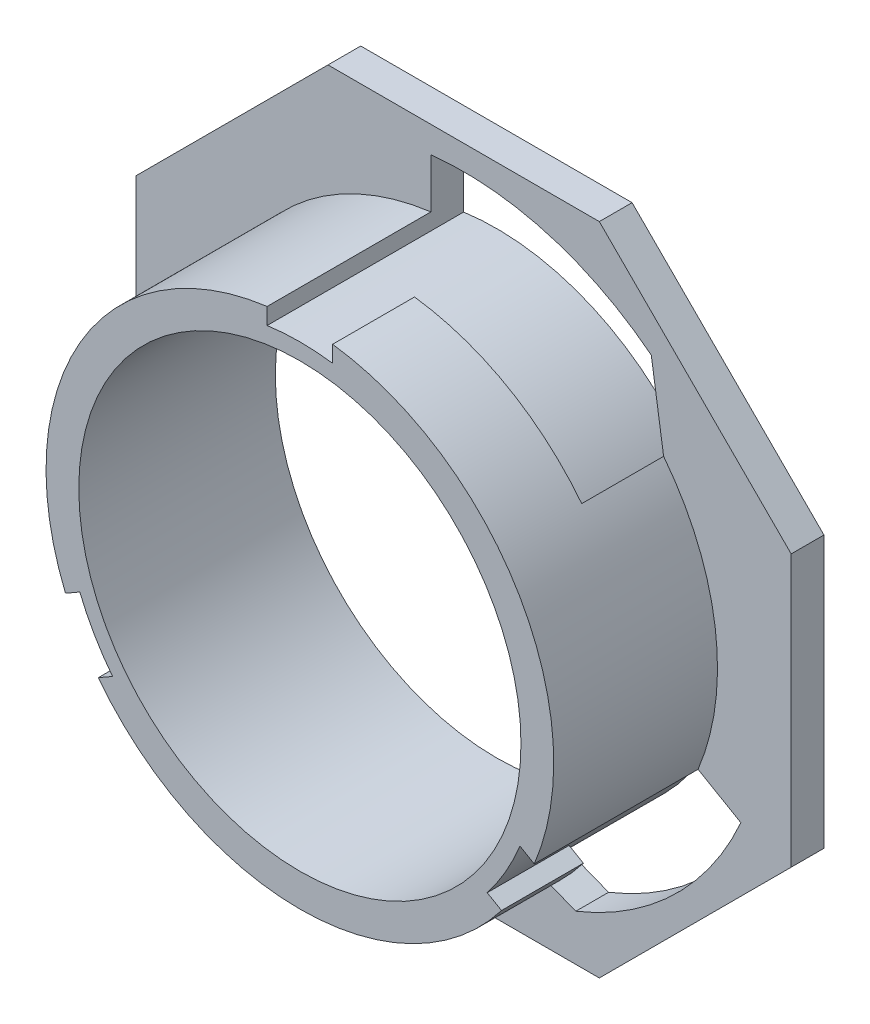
ISO-10303-21;
HEADER;
FILE_DESCRIPTION(('STEP AP214'),'2;1');
FILE_NAME('part.step','',(''),(''),'','','');
FILE_SCHEMA(('AUTOMOTIVE_DESIGN { 1 0 10303 214 1 1 1 1 }'));
ENDSEC;
DATA;
#1=APPLICATION_CONTEXT('core data for automotive mechanical design processes');
#2=APPLICATION_PROTOCOL_DEFINITION('international standard','automotive_design',2000,#1);
#3=PRODUCT_CONTEXT('',#1,'mechanical');
#4=PRODUCT('Part','Part','',(#3));
#5=PRODUCT_RELATED_PRODUCT_CATEGORY('part','',(#4));
#6=PRODUCT_DEFINITION_FORMATION('','',#4);
#7=PRODUCT_DEFINITION_CONTEXT('part definition',#1,'design');
#8=PRODUCT_DEFINITION('design','',#6,#7);
#9=PRODUCT_DEFINITION_SHAPE('','',#8);
#10=(LENGTH_UNIT() NAMED_UNIT(*) SI_UNIT(.MILLI.,.METRE.));
#11=(NAMED_UNIT(*) PLANE_ANGLE_UNIT() SI_UNIT($,.RADIAN.));
#12=(NAMED_UNIT(*) SI_UNIT($,.STERADIAN.) SOLID_ANGLE_UNIT());
#13=UNCERTAINTY_MEASURE_WITH_UNIT(LENGTH_MEASURE(1.E-05),#10,'distance_accuracy_value','');
#14=(GEOMETRIC_REPRESENTATION_CONTEXT(3) GLOBAL_UNCERTAINTY_ASSIGNED_CONTEXT((#13)) GLOBAL_UNIT_ASSIGNED_CONTEXT((#10,
#11,#12)) REPRESENTATION_CONTEXT('',''));
#15=CARTESIAN_POINT('',(0.,0.,0.));
#16=DIRECTION('',(0.,0.,1.));
#17=DIRECTION('',(1.,0.,0.));
#18=AXIS2_PLACEMENT_3D('',#15,#16,#17);
#19=CARTESIAN_POINT('',(0.,0.,12.));
#20=DIRECTION('',(0.,0.,-1.));
#21=DIRECTION('',(-1.,0.,0.));
#22=AXIS2_PLACEMENT_3D('',#19,#20,#21);
#23=CYLINDRICAL_SURFACE('',#22,15.5);
#24=CARTESIAN_POINT('',(0.,0.,12.));
#25=DIRECTION('',(0.,0.,1.));
#26=DIRECTION('',(1.,0.,0.));
#27=AXIS2_PLACEMENT_3D('',#24,#25,#26);
#28=CIRCLE('',#27,15.5);
#29=CARTESIAN_POINT('',(-12.3111795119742,-9.41726388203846,12.));
#30=VERTEX_POINT('',#29);
#31=CARTESIAN_POINT('',(12.3111795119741,-9.41726388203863,12.));
#32=VERTEX_POINT('',#31);
#33=EDGE_CURVE('E341',#30,#32,#28,.T.);
#34=ORIENTED_EDGE('',*,*,#33,.F.);
#35=DIRECTION('',(0.,0.,-1.));
#36=VECTOR('',#35,1.);
#37=CARTESIAN_POINT('',(-12.3111795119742,-9.41726388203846,12.));
#38=LINE('',#37,#36);
#39=CARTESIAN_POINT('',(-12.3111795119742,-9.41726388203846,2.));
#40=VERTEX_POINT('',#39);
#41=EDGE_CURVE('E11',#30,#40,#38,.T.);
#42=ORIENTED_EDGE('',*,*,#41,.T.);
#43=CARTESIAN_POINT('',(0.,0.,2.));
#44=DIRECTION('',(0.,0.,1.));
#45=DIRECTION('',(1.,0.,0.));
#46=AXIS2_PLACEMENT_3D('',#43,#44,#45);
#47=CIRCLE('',#46,15.5);
#48=CARTESIAN_POINT('',(2.16397596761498,-15.34819885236,2.));
#49=VERTEX_POINT('',#48);
#50=EDGE_CURVE('E345',#40,#49,#47,.T.);
#51=ORIENTED_EDGE('',*,*,#50,.T.);
#52=DIRECTION('',(0.,0.,-1.));
#53=VECTOR('',#52,1.);
#54=CARTESIAN_POINT('',(2.16397596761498,-15.34819885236,12.));
#55=LINE('',#54,#53);
#56=CARTESIAN_POINT('',(2.16397596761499,-15.34819885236,7.));
#57=VERTEX_POINT('',#56);
#58=EDGE_CURVE('E263',#49,#57,#55,.F.);
#59=ORIENTED_EDGE('',*,*,#58,.T.);
#60=CARTESIAN_POINT('',(0.,0.,7.));
#61=DIRECTION('',(0.,0.,-1.));
#62=DIRECTION('',(-1.,0.,0.));
#63=AXIS2_PLACEMENT_3D('',#60,#61,#62);
#64=CIRCLE('',#63,15.5);
#65=CARTESIAN_POINT('',(12.3111795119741,-9.41726388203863,7.));
#66=VERTEX_POINT('',#65);
#67=EDGE_CURVE('E268',#66,#57,#64,.T.);
#68=ORIENTED_EDGE('',*,*,#67,.F.);
#69=DIRECTION('',(0.,0.,-1.));
#70=VECTOR('',#69,1.);
#71=CARTESIAN_POINT('',(12.3111795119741,-9.41726388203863,12.));
#72=LINE('',#71,#70);
#73=EDGE_CURVE('E458',#32,#66,#72,.T.);
#74=ORIENTED_EDGE('',*,*,#73,.F.);
#75=EDGE_LOOP('',(#34,#42,#51,#59,#68,#74));
#76=FACE_BOUND('',#75,.T.);
#77=ADVANCED_FACE('F31',(#76),#23,.T.);
#78=CARTESIAN_POINT('',(14.3111795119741,-5.95316226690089,12.));
#79=VERTEX_POINT('',#78);
#80=CARTESIAN_POINT('',(2.,15.3704261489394,12.));
#81=VERTEX_POINT('',#80);
#82=EDGE_CURVE('E342',#79,#81,#28,.T.);
#83=ORIENTED_EDGE('',*,*,#82,.F.);
#84=DIRECTION('',(0.,0.,-1.));
#85=VECTOR('',#84,1.);
#86=CARTESIAN_POINT('',(14.3111795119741,-5.95316226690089,12.));
#87=LINE('',#86,#85);
#88=CARTESIAN_POINT('',(14.3111795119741,-5.95316226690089,2.));
#89=VERTEX_POINT('',#88);
#90=EDGE_CURVE('E260',#79,#89,#87,.T.);
#91=ORIENTED_EDGE('',*,*,#90,.T.);
#92=CARTESIAN_POINT('',(12.2099421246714,9.54815758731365,2.));
#93=VERTEX_POINT('',#92);
#94=EDGE_CURVE('E346',#89,#93,#47,.T.);
#95=ORIENTED_EDGE('',*,*,#94,.T.);
#96=DIRECTION('',(0.,0.,-1.));
#97=VECTOR('',#96,1.);
#98=CARTESIAN_POINT('',(12.2099421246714,9.54815758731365,12.));
#99=LINE('',#98,#97);
#100=CARTESIAN_POINT('',(12.2099421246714,9.54815758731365,7.));
#101=VERTEX_POINT('',#100);
#102=EDGE_CURVE('E273',#93,#101,#99,.F.);
#103=ORIENTED_EDGE('',*,*,#102,.T.);
#104=CARTESIAN_POINT('',(0.,0.,7.));
#105=DIRECTION('',(0.,0.,-1.));
#106=DIRECTION('',(-1.,0.,0.));
#107=AXIS2_PLACEMENT_3D('',#104,#105,#106);
#108=CIRCLE('',#107,15.5);
#109=CARTESIAN_POINT('',(2.,15.3704261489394,7.));
#110=VERTEX_POINT('',#109);
#111=EDGE_CURVE('E276',#110,#101,#108,.T.);
#112=ORIENTED_EDGE('',*,*,#111,.F.);
#113=DIRECTION('',(0.,0.,-1.));
#114=VECTOR('',#113,1.);
#115=CARTESIAN_POINT('',(2.,15.3704261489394,12.));
#116=LINE('',#115,#114);
#117=EDGE_CURVE('E382',#81,#110,#116,.T.);
#118=ORIENTED_EDGE('',*,*,#117,.F.);
#119=EDGE_LOOP('',(#83,#91,#95,#103,#112,#118));
#120=FACE_BOUND('',#119,.T.);
#121=ADVANCED_FACE('F527',(#120),#23,.T.);
#122=CARTESIAN_POINT('',(20.,20.,2.));
#123=DIRECTION('',(0.,0.,1.));
#124=DIRECTION('',(1.,0.,0.));
#125=AXIS2_PLACEMENT_3D('',#122,#123,#124);
#126=PLANE('',#125);
#127=DIRECTION('',(0.866025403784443,0.499999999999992,0.));
#128=VECTOR('',#127,1.);
#129=CARTESIAN_POINT('',(24.6602540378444,11.9282032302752,2.));
#130=LINE('',#129,#128);
#131=CARTESIAN_POINT('',(-14.9275704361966,-10.9278378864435,2.));
#132=VERTEX_POINT('',#131);
#133=EDGE_CURVE('E430',#132,#40,#130,.T.);
#134=ORIENTED_EDGE('',*,*,#133,.F.);
#135=CARTESIAN_POINT('',(0.,0.,2.));
#136=DIRECTION('',(0.,0.,1.));
#137=DIRECTION('',(1.,0.,0.));
#138=AXIS2_PLACEMENT_3D('',#135,#136,#137);
#139=CIRCLE('',#138,18.5);
#140=CARTESIAN_POINT('',(-18.3077579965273,2.66007464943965,2.));
#141=VERTEX_POINT('',#140);
#142=EDGE_CURVE('E428',#141,#132,#139,.T.);
#143=ORIENTED_EDGE('',*,*,#142,.F.);
#144=DIRECTION('',(-0.78155694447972,-0.623833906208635,0.));
#145=VECTOR('',#144,1.);
#146=CARTESIAN_POINT('',(13.5461018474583,28.0856280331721,2.));
#147=LINE('',#146,#145);
#148=CARTESIAN_POINT('',(-14.3739180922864,5.80004126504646,2.));
#149=VERTEX_POINT('',#148);
#150=EDGE_CURVE('E432',#149,#141,#147,.T.);
#151=ORIENTED_EDGE('',*,*,#150,.F.);
#152=CARTESIAN_POINT('',(-2.,15.3704261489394,2.));
#153=VERTEX_POINT('',#152);
#154=EDGE_CURVE('E343',#153,#149,#47,.T.);
#155=ORIENTED_EDGE('',*,*,#154,.F.);
#156=DIRECTION('',(0.,-1.,0.));
#157=VECTOR('',#156,1.);
#158=CARTESIAN_POINT('',(-2.,20.,2.));
#159=LINE('',#158,#157);
#160=CARTESIAN_POINT('',(-2.,18.3915741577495,2.));
#161=VERTEX_POINT('',#160);
#162=EDGE_CURVE('E352',#161,#153,#159,.T.);
#163=ORIENTED_EDGE('',*,*,#162,.F.);
#164=CARTESIAN_POINT('',(0.,0.,2.));
#165=DIRECTION('',(0.,0.,1.));
#166=DIRECTION('',(1.,0.,0.));
#167=AXIS2_PLACEMENT_3D('',#164,#165,#166);
#168=CIRCLE('',#167,18.5);
#169=CARTESIAN_POINT('',(11.4575712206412,14.5249461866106,2.));
#170=VERTEX_POINT('',#169);
#171=EDGE_CURVE('E350',#170,#161,#168,.T.);
#172=ORIENTED_EDGE('',*,*,#171,.F.);
#173=DIRECTION('',(-0.149477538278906,0.988765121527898,0.));
#174=VECTOR('',#173,1.);
#175=CARTESIAN_POINT('',(10.8392363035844,18.6151125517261,2.));
#176=LINE('',#175,#174);
#177=EDGE_CURVE('E354',#93,#170,#176,.T.);
#178=ORIENTED_EDGE('',*,*,#177,.F.);
#179=ORIENTED_EDGE('',*,*,#94,.F.);
#180=DIRECTION('',(-0.866025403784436,0.500000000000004,0.));
#181=VECTOR('',#180,1.);
#182=CARTESIAN_POINT('',(7.3397459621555,-1.92820323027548,2.));
#183=LINE('',#182,#181);
#184=CARTESIAN_POINT('',(16.9275704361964,-7.46373627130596,2.));
#185=VERTEX_POINT('',#184);
#186=EDGE_CURVE('E399',#185,#89,#183,.T.);
#187=ORIENTED_EDGE('',*,*,#186,.F.);
#188=CARTESIAN_POINT('',(0.,0.,2.));
#189=DIRECTION('',(0.,0.,1.));
#190=DIRECTION('',(1.,0.,0.));
#191=AXIS2_PLACEMENT_3D('',#188,#189,#190);
#192=CIRCLE('',#191,18.5);
#193=CARTESIAN_POINT('',(6.85018677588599,-17.1850208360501,2.));
#194=VERTEX_POINT('',#193);
#195=EDGE_CURVE('E397',#194,#185,#192,.T.);
#196=ORIENTED_EDGE('',*,*,#195,.F.);
#197=DIRECTION('',(0.931034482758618,-0.36493121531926,0.));
#198=VECTOR('',#197,1.);
#199=CARTESIAN_POINT('',(5.61466184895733,-16.7007405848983,2.));
#200=LINE('',#199,#198);
#201=EDGE_CURVE('E401',#49,#194,#200,.T.);
#202=ORIENTED_EDGE('',*,*,#201,.F.);
#203=ORIENTED_EDGE('',*,*,#50,.F.);
#204=EDGE_LOOP('',(#134,#143,#151,#155,#163,#172,#178,#179,#187,#196,#202,#203));
#205=FACE_BOUND('',#204,.T.);
#206=DIRECTION('',(0.,1.,0.));
#207=VECTOR('',#206,1.);
#208=CARTESIAN_POINT('',(20.,-8.2842712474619,2.));
#209=LINE('',#208,#207);
#210=CARTESIAN_POINT('',(20.,-8.2842712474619,2.));
#211=VERTEX_POINT('',#210);
#212=CARTESIAN_POINT('',(20.,8.28427124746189,2.));
#213=VERTEX_POINT('',#212);
#214=EDGE_CURVE('E316',#211,#213,#209,.T.);
#215=ORIENTED_EDGE('',*,*,#214,.T.);
#216=DIRECTION('',(-0.707106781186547,0.707106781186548,0.));
#217=VECTOR('',#216,1.);
#218=CARTESIAN_POINT('',(20.,8.28427124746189,2.));
#219=LINE('',#218,#217);
#220=CARTESIAN_POINT('',(8.2842712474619,20.,2.));
#221=VERTEX_POINT('',#220);
#222=EDGE_CURVE('E314',#213,#221,#219,.T.);
#223=ORIENTED_EDGE('',*,*,#222,.T.);
#224=DIRECTION('',(-1.,0.,0.));
#225=VECTOR('',#224,1.);
#226=CARTESIAN_POINT('',(8.2842712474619,20.,2.));
#227=LINE('',#226,#225);
#228=CARTESIAN_POINT('',(-8.28427124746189,20.,2.));
#229=VERTEX_POINT('',#228);
#230=EDGE_CURVE('E312',#221,#229,#227,.T.);
#231=ORIENTED_EDGE('',*,*,#230,.T.);
#232=DIRECTION('',(-0.707106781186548,-0.707106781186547,0.));
#233=VECTOR('',#232,1.);
#234=CARTESIAN_POINT('',(-8.28427124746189,20.,2.));
#235=LINE('',#234,#233);
#236=CARTESIAN_POINT('',(-20.,8.2842712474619,2.));
#237=VERTEX_POINT('',#236);
#238=EDGE_CURVE('E310',#229,#237,#235,.T.);
#239=ORIENTED_EDGE('',*,*,#238,.T.);
#240=DIRECTION('',(0.,-1.,0.));
#241=VECTOR('',#240,1.);
#242=CARTESIAN_POINT('',(-20.,8.2842712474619,2.));
#243=LINE('',#242,#241);
#244=CARTESIAN_POINT('',(-20.,-8.28427124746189,2.));
#245=VERTEX_POINT('',#244);
#246=EDGE_CURVE('E308',#237,#245,#243,.T.);
#247=ORIENTED_EDGE('',*,*,#246,.T.);
#248=DIRECTION('',(0.707106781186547,-0.707106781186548,0.));
#249=VECTOR('',#248,1.);
#250=CARTESIAN_POINT('',(-20.,-8.28427124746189,2.));
#251=LINE('',#250,#249);
#252=CARTESIAN_POINT('',(-8.28427124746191,-20.,2.));
#253=VERTEX_POINT('',#252);
#254=EDGE_CURVE('E306',#245,#253,#251,.T.);
#255=ORIENTED_EDGE('',*,*,#254,.T.);
#256=DIRECTION('',(1.,0.,0.));
#257=VECTOR('',#256,1.);
#258=CARTESIAN_POINT('',(-8.28427124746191,-20.,2.));
#259=LINE('',#258,#257);
#260=CARTESIAN_POINT('',(8.28427124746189,-20.,2.));
#261=VERTEX_POINT('',#260);
#262=EDGE_CURVE('E304',#253,#261,#259,.T.);
#263=ORIENTED_EDGE('',*,*,#262,.T.);
#264=DIRECTION('',(0.707106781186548,0.707106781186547,0.));
#265=VECTOR('',#264,1.);
#266=CARTESIAN_POINT('',(8.28427124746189,-20.,2.));
#267=LINE('',#266,#265);
#268=EDGE_CURVE('E302',#261,#211,#267,.T.);
#269=ORIENTED_EDGE('',*,*,#268,.T.);
#270=EDGE_LOOP('',(#215,#223,#231,#239,#247,#255,#263,#269));
#271=FACE_BOUND('',#270,.T.);
#272=ADVANCED_FACE('F488',(#205,#271),#126,.T.);
#273=CARTESIAN_POINT('',(20.,20.,0.));
#274=DIRECTION('',(0.,0.,1.));
#275=DIRECTION('',(1.,0.,0.));
#276=AXIS2_PLACEMENT_3D('',#273,#274,#275);
#277=PLANE('',#276);
#278=DIRECTION('',(0.78155694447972,0.623833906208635,0.));
#279=VECTOR('',#278,1.);
#280=CARTESIAN_POINT('',(-18.3077579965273,2.66007464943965,0.));
#281=LINE('',#280,#279);
#282=CARTESIAN_POINT('',(-18.3077579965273,2.66007464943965,0.));
#283=VERTEX_POINT('',#282);
#284=CARTESIAN_POINT('',(-12.5573683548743,7.25000000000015,0.));
#285=VERTEX_POINT('',#284);
#286=EDGE_CURVE('E452',#283,#285,#281,.T.);
#287=ORIENTED_EDGE('',*,*,#286,.F.);
#288=CARTESIAN_POINT('',(0.,0.,0.));
#289=DIRECTION('',(0.,0.,-1.));
#290=DIRECTION('',(0.499999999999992,-0.866025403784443,0.));
#291=AXIS2_PLACEMENT_3D('',#288,#289,#290);
#292=CIRCLE('',#291,18.5);
#293=CARTESIAN_POINT('',(-14.9275704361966,-10.9278378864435,0.));
#294=VERTEX_POINT('',#293);
#295=EDGE_CURVE('E455',#294,#283,#292,.T.);
#296=ORIENTED_EDGE('',*,*,#295,.F.);
#297=DIRECTION('',(-0.866025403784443,-0.499999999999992,0.));
#298=VECTOR('',#297,1.);
#299=CARTESIAN_POINT('',(-11.4373429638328,-8.91275411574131,0.));
#300=LINE('',#299,#298);
#301=CARTESIAN_POINT('',(-11.4373429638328,-8.91275411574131,0.));
#302=VERTEX_POINT('',#301);
#303=EDGE_CURVE('E446',#302,#294,#300,.T.);
#304=ORIENTED_EDGE('',*,*,#303,.F.);
#305=CARTESIAN_POINT('',(0.,0.,0.));
#306=DIRECTION('',(0.,0.,1.));
#307=DIRECTION('',(0.499999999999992,-0.866025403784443,0.));
#308=AXIS2_PLACEMENT_3D('',#305,#306,#307);
#309=CIRCLE('',#308,14.5);
#310=EDGE_CURVE('E449',#285,#302,#309,.T.);
#311=ORIENTED_EDGE('',*,*,#310,.F.);
#312=EDGE_LOOP('',(#287,#296,#304,#311));
#313=FACE_BOUND('',#312,.T.);
#314=DIRECTION('',(-0.931034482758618,0.36493121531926,0.));
#315=VECTOR('',#314,1.);
#316=CARTESIAN_POINT('',(6.85018677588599,-17.1850208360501,0.));
#317=LINE('',#316,#315);
#318=CARTESIAN_POINT('',(6.85018677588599,-17.1850208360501,0.));
#319=VERTEX_POINT('',#318);
#320=CARTESIAN_POINT('',(-1.0321604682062E-13,-14.5,0.));
#321=VERTEX_POINT('',#320);
#322=EDGE_CURVE('E423',#319,#321,#317,.T.);
#323=ORIENTED_EDGE('',*,*,#322,.F.);
#324=CARTESIAN_POINT('',(0.,0.,0.));
#325=DIRECTION('',(0.,0.,-1.));
#326=DIRECTION('',(0.500000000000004,0.866025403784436,0.));
#327=AXIS2_PLACEMENT_3D('',#324,#325,#326);
#328=CIRCLE('',#327,18.5);
#329=CARTESIAN_POINT('',(16.9275704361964,-7.46373627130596,0.));
#330=VERTEX_POINT('',#329);
#331=EDGE_CURVE('E426',#330,#319,#328,.T.);
#332=ORIENTED_EDGE('',*,*,#331,.F.);
#333=DIRECTION('',(0.866025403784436,-0.500000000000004,0.));
#334=VECTOR('',#333,1.);
#335=CARTESIAN_POINT('',(13.4373429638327,-5.44865250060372,0.));
#336=LINE('',#335,#334);
#337=CARTESIAN_POINT('',(13.4373429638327,-5.44865250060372,0.));
#338=VERTEX_POINT('',#337);
#339=EDGE_CURVE('E417',#338,#330,#336,.T.);
#340=ORIENTED_EDGE('',*,*,#339,.F.);
#341=CARTESIAN_POINT('',(0.,0.,0.));
#342=DIRECTION('',(0.,0.,1.));
#343=DIRECTION('',(0.500000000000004,0.866025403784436,0.));
#344=AXIS2_PLACEMENT_3D('',#341,#342,#343);
#345=CIRCLE('',#344,14.5);
#346=EDGE_CURVE('E420',#321,#338,#345,.T.);
#347=ORIENTED_EDGE('',*,*,#346,.F.);
#348=EDGE_LOOP('',(#323,#332,#340,#347));
#349=FACE_BOUND('',#348,.T.);
#350=DIRECTION('',(0.149477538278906,-0.988765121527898,0.));
#351=VECTOR('',#350,1.);
#352=CARTESIAN_POINT('',(11.4575712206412,14.5249461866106,0.));
#353=LINE('',#352,#351);
#354=CARTESIAN_POINT('',(11.4575712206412,14.5249461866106,0.));
#355=VERTEX_POINT('',#354);
#356=CARTESIAN_POINT('',(12.5573683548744,7.24999999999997,0.));
#357=VERTEX_POINT('',#356);
#358=EDGE_CURVE('E376',#355,#357,#353,.T.);
#359=ORIENTED_EDGE('',*,*,#358,.F.);
#360=CARTESIAN_POINT('',(0.,0.,0.));
#361=DIRECTION('',(0.,0.,-1.));
#362=DIRECTION('',(-1.,0.,0.));
#363=AXIS2_PLACEMENT_3D('',#360,#361,#362);
#364=CIRCLE('',#363,18.5);
#365=CARTESIAN_POINT('',(-2.,18.3915741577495,0.));
#366=VERTEX_POINT('',#365);
#367=EDGE_CURVE('E379',#366,#355,#364,.T.);
#368=ORIENTED_EDGE('',*,*,#367,.F.);
#369=DIRECTION('',(0.,1.,0.));
#370=VECTOR('',#369,1.);
#371=CARTESIAN_POINT('',(-2.,14.3614066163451,0.));
#372=LINE('',#371,#370);
#373=CARTESIAN_POINT('',(-2.,14.3614066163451,0.));
#374=VERTEX_POINT('',#373);
#375=EDGE_CURVE('E370',#374,#366,#372,.T.);
#376=ORIENTED_EDGE('',*,*,#375,.F.);
#377=CARTESIAN_POINT('',(0.,0.,0.));
#378=DIRECTION('',(0.,0.,1.));
#379=DIRECTION('',(-1.,0.,0.));
#380=AXIS2_PLACEMENT_3D('',#377,#378,#379);
#381=CIRCLE('',#380,14.5);
#382=EDGE_CURVE('E373',#357,#374,#381,.T.);
#383=ORIENTED_EDGE('',*,*,#382,.F.);
#384=EDGE_LOOP('',(#359,#368,#376,#383));
#385=FACE_BOUND('',#384,.T.);
#386=DIRECTION('',(0.,1.,0.));
#387=VECTOR('',#386,1.);
#388=CARTESIAN_POINT('',(20.,-8.2842712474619,0.));
#389=LINE('',#388,#387);
#390=CARTESIAN_POINT('',(20.,-8.2842712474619,0.));
#391=VERTEX_POINT('',#390);
#392=CARTESIAN_POINT('',(20.,8.28427124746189,0.));
#393=VERTEX_POINT('',#392);
#394=EDGE_CURVE('E333',#391,#393,#389,.T.);
#395=ORIENTED_EDGE('',*,*,#394,.F.);
#396=DIRECTION('',(0.707106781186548,0.707106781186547,0.));
#397=VECTOR('',#396,1.);
#398=CARTESIAN_POINT('',(8.28427124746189,-20.,0.));
#399=LINE('',#398,#397);
#400=CARTESIAN_POINT('',(8.28427124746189,-20.,0.));
#401=VERTEX_POINT('',#400);
#402=EDGE_CURVE('E319',#401,#391,#399,.T.);
#403=ORIENTED_EDGE('',*,*,#402,.F.);
#404=DIRECTION('',(1.,0.,0.));
#405=VECTOR('',#404,1.);
#406=CARTESIAN_POINT('',(-8.28427124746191,-20.,0.));
#407=LINE('',#406,#405);
#408=CARTESIAN_POINT('',(-8.28427124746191,-20.,0.));
#409=VERTEX_POINT('',#408);
#410=EDGE_CURVE('E321',#409,#401,#407,.T.);
#411=ORIENTED_EDGE('',*,*,#410,.F.);
#412=DIRECTION('',(0.707106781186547,-0.707106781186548,0.));
#413=VECTOR('',#412,1.);
#414=CARTESIAN_POINT('',(-20.,-8.28427124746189,0.));
#415=LINE('',#414,#413);
#416=CARTESIAN_POINT('',(-20.,-8.28427124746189,0.));
#417=VERTEX_POINT('',#416);
#418=EDGE_CURVE('E323',#417,#409,#415,.T.);
#419=ORIENTED_EDGE('',*,*,#418,.F.);
#420=DIRECTION('',(0.,-1.,0.));
#421=VECTOR('',#420,1.);
#422=CARTESIAN_POINT('',(-20.,8.2842712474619,0.));
#423=LINE('',#422,#421);
#424=CARTESIAN_POINT('',(-20.,8.2842712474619,0.));
#425=VERTEX_POINT('',#424);
#426=EDGE_CURVE('E325',#425,#417,#423,.T.);
#427=ORIENTED_EDGE('',*,*,#426,.F.);
#428=DIRECTION('',(-0.707106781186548,-0.707106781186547,0.));
#429=VECTOR('',#428,1.);
#430=CARTESIAN_POINT('',(-8.28427124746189,20.,0.));
#431=LINE('',#430,#429);
#432=CARTESIAN_POINT('',(-8.28427124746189,20.,0.));
#433=VERTEX_POINT('',#432);
#434=EDGE_CURVE('E327',#433,#425,#431,.T.);
#435=ORIENTED_EDGE('',*,*,#434,.F.);
#436=DIRECTION('',(-1.,0.,0.));
#437=VECTOR('',#436,1.);
#438=CARTESIAN_POINT('',(8.2842712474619,20.,0.));
#439=LINE('',#438,#437);
#440=CARTESIAN_POINT('',(8.2842712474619,20.,0.));
#441=VERTEX_POINT('',#440);
#442=EDGE_CURVE('E329',#441,#433,#439,.T.);
#443=ORIENTED_EDGE('',*,*,#442,.F.);
#444=DIRECTION('',(-0.707106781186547,0.707106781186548,0.));
#445=VECTOR('',#444,1.);
#446=CARTESIAN_POINT('',(20.,8.28427124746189,0.));
#447=LINE('',#446,#445);
#448=EDGE_CURVE('E331',#393,#441,#447,.T.);
#449=ORIENTED_EDGE('',*,*,#448,.F.);
#450=EDGE_LOOP('',(#395,#403,#411,#419,#427,#435,#443,#449));
#451=FACE_BOUND('',#450,.T.);
#452=CARTESIAN_POINT('',(0.,0.,0.));
#453=DIRECTION('',(0.,0.,1.));
#454=DIRECTION('',(1.,0.,0.));
#455=AXIS2_PLACEMENT_3D('',#452,#453,#454);
#456=CIRCLE('',#455,13.5);
#457=CARTESIAN_POINT('',(13.5,0.,0.));
#458=VERTEX_POINT('',#457);
#459=EDGE_CURVE('E336',#458,#458,#456,.T.);
#460=ORIENTED_EDGE('',*,*,#459,.T.);
#461=EDGE_LOOP('',(#460));
#462=FACE_BOUND('',#461,.T.);
#463=ADVANCED_FACE('F502',(#313,#349,#385,#451,#462),#277,.F.);
#464=CARTESIAN_POINT('',(20.,-8.2842712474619,2.));
#465=DIRECTION('',(-1.,0.,0.));
#466=DIRECTION('',(0.,-1.,0.));
#467=AXIS2_PLACEMENT_3D('',#464,#465,#466);
#468=PLANE('',#467);
#469=ORIENTED_EDGE('',*,*,#394,.T.);
#470=DIRECTION('',(0.,0.,-1.));
#471=VECTOR('',#470,1.);
#472=CARTESIAN_POINT('',(20.,8.28427124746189,2.));
#473=LINE('',#472,#471);
#474=EDGE_CURVE('E278',#213,#393,#473,.T.);
#475=ORIENTED_EDGE('',*,*,#474,.F.);
#476=ORIENTED_EDGE('',*,*,#214,.F.);
#477=DIRECTION('',(0.,0.,-1.));
#478=VECTOR('',#477,1.);
#479=CARTESIAN_POINT('',(20.,-8.2842712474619,2.));
#480=LINE('',#479,#478);
#481=EDGE_CURVE('E299',#211,#391,#480,.T.);
#482=ORIENTED_EDGE('',*,*,#481,.T.);
#483=EDGE_LOOP('',(#469,#475,#476,#482));
#484=FACE_BOUND('',#483,.T.);
#485=ADVANCED_FACE('F33',(#484),#468,.F.);
#486=CARTESIAN_POINT('',(20.,8.28427124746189,2.));
#487=DIRECTION('',(-0.707106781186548,-0.707106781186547,0.));
#488=DIRECTION('',(0.707106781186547,-0.707106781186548,0.));
#489=AXIS2_PLACEMENT_3D('',#486,#487,#488);
#490=PLANE('',#489);
#491=ORIENTED_EDGE('',*,*,#448,.T.);
#492=DIRECTION('',(0.,0.,-1.));
#493=VECTOR('',#492,1.);
#494=CARTESIAN_POINT('',(8.2842712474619,20.,2.));
#495=LINE('',#494,#493);
#496=EDGE_CURVE('E281',#221,#441,#495,.T.);
#497=ORIENTED_EDGE('',*,*,#496,.F.);
#498=ORIENTED_EDGE('',*,*,#222,.F.);
#499=ORIENTED_EDGE('',*,*,#474,.T.);
#500=EDGE_LOOP('',(#491,#497,#498,#499));
#501=FACE_BOUND('',#500,.T.);
#502=ADVANCED_FACE('F771',(#501),#490,.F.);
#503=CARTESIAN_POINT('',(8.2842712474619,20.,2.));
#504=DIRECTION('',(0.,-1.,0.));
#505=DIRECTION('',(1.,0.,0.));
#506=AXIS2_PLACEMENT_3D('',#503,#504,#505);
#507=PLANE('',#506);
#508=ORIENTED_EDGE('',*,*,#442,.T.);
#509=DIRECTION('',(0.,0.,-1.));
#510=VECTOR('',#509,1.);
#511=CARTESIAN_POINT('',(-8.28427124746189,20.,2.));
#512=LINE('',#511,#510);
#513=EDGE_CURVE('E284',#229,#433,#512,.T.);
#514=ORIENTED_EDGE('',*,*,#513,.F.);
#515=ORIENTED_EDGE('',*,*,#230,.F.);
#516=ORIENTED_EDGE('',*,*,#496,.T.);
#517=EDGE_LOOP('',(#508,#514,#515,#516));
#518=FACE_BOUND('',#517,.T.);
#519=ADVANCED_FACE('F761',(#518),#507,.F.);
#520=CARTESIAN_POINT('',(-8.28427124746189,20.,2.));
#521=DIRECTION('',(0.707106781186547,-0.707106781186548,0.));
#522=DIRECTION('',(0.707106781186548,0.707106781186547,0.));
#523=AXIS2_PLACEMENT_3D('',#520,#521,#522);
#524=PLANE('',#523);
#525=ORIENTED_EDGE('',*,*,#434,.T.);
#526=DIRECTION('',(0.,0.,-1.));
#527=VECTOR('',#526,1.);
#528=CARTESIAN_POINT('',(-20.,8.2842712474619,2.));
#529=LINE('',#528,#527);
#530=EDGE_CURVE('E287',#237,#425,#529,.T.);
#531=ORIENTED_EDGE('',*,*,#530,.F.);
#532=ORIENTED_EDGE('',*,*,#238,.F.);
#533=ORIENTED_EDGE('',*,*,#513,.T.);
#534=EDGE_LOOP('',(#525,#531,#532,#533));
#535=FACE_BOUND('',#534,.T.);
#536=ADVANCED_FACE('F751',(#535),#524,.F.);
#537=CARTESIAN_POINT('',(-20.,8.2842712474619,2.));
#538=DIRECTION('',(1.,0.,0.));
#539=DIRECTION('',(0.,1.,0.));
#540=AXIS2_PLACEMENT_3D('',#537,#538,#539);
#541=PLANE('',#540);
#542=ORIENTED_EDGE('',*,*,#426,.T.);
#543=DIRECTION('',(0.,0.,-1.));
#544=VECTOR('',#543,1.);
#545=CARTESIAN_POINT('',(-20.,-8.28427124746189,2.));
#546=LINE('',#545,#544);
#547=EDGE_CURVE('E290',#245,#417,#546,.T.);
#548=ORIENTED_EDGE('',*,*,#547,.F.);
#549=ORIENTED_EDGE('',*,*,#246,.F.);
#550=ORIENTED_EDGE('',*,*,#530,.T.);
#551=EDGE_LOOP('',(#542,#548,#549,#550));
#552=FACE_BOUND('',#551,.T.);
#553=ADVANCED_FACE('F741',(#552),#541,.F.);
#554=CARTESIAN_POINT('',(-20.,-8.28427124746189,2.));
#555=DIRECTION('',(0.707106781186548,0.707106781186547,0.));
#556=DIRECTION('',(-0.707106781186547,0.707106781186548,0.));
#557=AXIS2_PLACEMENT_3D('',#554,#555,#556);
#558=PLANE('',#557);
#559=ORIENTED_EDGE('',*,*,#418,.T.);
#560=DIRECTION('',(0.,0.,-1.));
#561=VECTOR('',#560,1.);
#562=CARTESIAN_POINT('',(-8.28427124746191,-20.,2.));
#563=LINE('',#562,#561);
#564=EDGE_CURVE('E293',#253,#409,#563,.T.);
#565=ORIENTED_EDGE('',*,*,#564,.F.);
#566=ORIENTED_EDGE('',*,*,#254,.F.);
#567=ORIENTED_EDGE('',*,*,#547,.T.);
#568=EDGE_LOOP('',(#559,#565,#566,#567));
#569=FACE_BOUND('',#568,.T.);
#570=ADVANCED_FACE('F731',(#569),#558,.F.);
#571=CARTESIAN_POINT('',(-8.28427124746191,-20.,2.));
#572=DIRECTION('',(0.,1.,0.));
#573=DIRECTION('',(-1.,0.,0.));
#574=AXIS2_PLACEMENT_3D('',#571,#572,#573);
#575=PLANE('',#574);
#576=ORIENTED_EDGE('',*,*,#410,.T.);
#577=DIRECTION('',(0.,0.,-1.));
#578=VECTOR('',#577,1.);
#579=CARTESIAN_POINT('',(8.28427124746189,-20.,2.));
#580=LINE('',#579,#578);
#581=EDGE_CURVE('E296',#261,#401,#580,.T.);
#582=ORIENTED_EDGE('',*,*,#581,.F.);
#583=ORIENTED_EDGE('',*,*,#262,.F.);
#584=ORIENTED_EDGE('',*,*,#564,.T.);
#585=EDGE_LOOP('',(#576,#582,#583,#584));
#586=FACE_BOUND('',#585,.T.);
#587=ADVANCED_FACE('F722',(#586),#575,.F.);
#588=CARTESIAN_POINT('',(8.28427124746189,-20.,2.));
#589=DIRECTION('',(-0.707106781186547,0.707106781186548,0.));
#590=DIRECTION('',(-0.707106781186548,-0.707106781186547,0.));
#591=AXIS2_PLACEMENT_3D('',#588,#589,#590);
#592=PLANE('',#591);
#593=ORIENTED_EDGE('',*,*,#402,.T.);
#594=ORIENTED_EDGE('',*,*,#481,.F.);
#595=ORIENTED_EDGE('',*,*,#268,.F.);
#596=ORIENTED_EDGE('',*,*,#581,.T.);
#597=EDGE_LOOP('',(#593,#594,#595,#596));
#598=FACE_BOUND('',#597,.T.);
#599=ADVANCED_FACE('F571',(#598),#592,.F.);
#600=CARTESIAN_POINT('',(0.,0.,2.));
#601=DIRECTION('',(0.,0.,-1.));
#602=DIRECTION('',(-1.,0.,0.));
#603=AXIS2_PLACEMENT_3D('',#600,#601,#602);
#604=CYLINDRICAL_SURFACE('',#603,13.5);
#605=ORIENTED_EDGE('',*,*,#459,.F.);
#606=EDGE_LOOP('',(#605));
#607=FACE_BOUND('',#606,.T.);
#608=CARTESIAN_POINT('',(0.,0.,12.));
#609=DIRECTION('',(0.,0.,1.));
#610=DIRECTION('',(1.,0.,0.));
#611=AXIS2_PLACEMENT_3D('',#608,#609,#610);
#612=CIRCLE('',#611,13.5);
#613=CARTESIAN_POINT('',(13.5,0.,12.));
#614=VERTEX_POINT('',#613);
#615=EDGE_CURVE('E347',#614,#614,#612,.T.);
#616=ORIENTED_EDGE('',*,*,#615,.T.);
#617=EDGE_LOOP('',(#616));
#618=FACE_BOUND('',#617,.T.);
#619=ADVANCED_FACE('F567',(#607,#618),#604,.F.);
#620=CARTESIAN_POINT('',(0.,0.,12.));
#621=DIRECTION('',(0.,0.,1.));
#622=DIRECTION('',(1.,0.,0.));
#623=AXIS2_PLACEMENT_3D('',#620,#621,#622);
#624=PLANE('',#623);
#625=DIRECTION('',(-0.866025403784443,-0.499999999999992,0.));
#626=VECTOR('',#625,1.);
#627=CARTESIAN_POINT('',(-11.4373429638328,-8.91275411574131,12.));
#628=LINE('',#627,#626);
#629=CARTESIAN_POINT('',(-11.4373429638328,-8.91275411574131,12.));
#630=VERTEX_POINT('',#629);
#631=EDGE_CURVE('E247',#630,#30,#628,.T.);
#632=ORIENTED_EDGE('',*,*,#631,.T.);
#633=ORIENTED_EDGE('',*,*,#33,.T.);
#634=DIRECTION('',(-0.866025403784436,0.500000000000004,0.));
#635=VECTOR('',#634,1.);
#636=CARTESIAN_POINT('',(12.3111795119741,-9.41726388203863,12.));
#637=LINE('',#636,#635);
#638=CARTESIAN_POINT('',(11.4373429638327,-8.91275411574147,12.));
#639=VERTEX_POINT('',#638);
#640=EDGE_CURVE('E467',#32,#639,#637,.T.);
#641=ORIENTED_EDGE('',*,*,#640,.T.);
#642=CARTESIAN_POINT('',(0.,0.,12.));
#643=DIRECTION('',(0.,0.,1.));
#644=DIRECTION('',(0.500000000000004,0.866025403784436,0.));
#645=AXIS2_PLACEMENT_3D('',#642,#643,#644);
#646=CIRCLE('',#645,14.5);
#647=CARTESIAN_POINT('',(13.4373429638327,-5.44865250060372,12.));
#648=VERTEX_POINT('',#647);
#649=EDGE_CURVE('E464',#639,#648,#646,.T.);
#650=ORIENTED_EDGE('',*,*,#649,.T.);
#651=DIRECTION('',(0.866025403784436,-0.500000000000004,0.));
#652=VECTOR('',#651,1.);
#653=CARTESIAN_POINT('',(13.4373429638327,-5.44865250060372,12.));
#654=LINE('',#653,#652);
#655=EDGE_CURVE('E460',#648,#79,#654,.T.);
#656=ORIENTED_EDGE('',*,*,#655,.T.);
#657=ORIENTED_EDGE('',*,*,#82,.T.);
#658=DIRECTION('',(0.,-1.,0.));
#659=VECTOR('',#658,1.);
#660=CARTESIAN_POINT('',(2.,15.3704261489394,12.));
#661=LINE('',#660,#659);
#662=CARTESIAN_POINT('',(2.,14.3614066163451,12.));
#663=VERTEX_POINT('',#662);
#664=EDGE_CURVE('E392',#81,#663,#661,.T.);
#665=ORIENTED_EDGE('',*,*,#664,.T.);
#666=CARTESIAN_POINT('',(0.,0.,12.));
#667=DIRECTION('',(0.,0.,1.));
#668=DIRECTION('',(-1.,0.,0.));
#669=AXIS2_PLACEMENT_3D('',#666,#667,#668);
#670=CIRCLE('',#669,14.5);
#671=CARTESIAN_POINT('',(-2.,14.3614066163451,12.));
#672=VERTEX_POINT('',#671);
#673=EDGE_CURVE('E389',#663,#672,#670,.T.);
#674=ORIENTED_EDGE('',*,*,#673,.T.);
#675=DIRECTION('',(0.,1.,0.));
#676=VECTOR('',#675,1.);
#677=CARTESIAN_POINT('',(-2.,14.3614066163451,12.));
#678=LINE('',#677,#676);
#679=CARTESIAN_POINT('',(-2.,15.3704261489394,12.));
#680=VERTEX_POINT('',#679);
#681=EDGE_CURVE('E384',#672,#680,#678,.T.);
#682=ORIENTED_EDGE('',*,*,#681,.T.);
#683=CARTESIAN_POINT('',(-14.3111795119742,-5.95316226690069,12.));
#684=VERTEX_POINT('',#683);
#685=EDGE_CURVE('E339',#680,#684,#28,.T.);
#686=ORIENTED_EDGE('',*,*,#685,.T.);
#687=DIRECTION('',(0.866025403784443,0.499999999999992,0.));
#688=VECTOR('',#687,1.);
#689=CARTESIAN_POINT('',(-14.3111795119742,-5.95316226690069,12.));
#690=LINE('',#689,#688);
#691=CARTESIAN_POINT('',(-13.4373429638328,-5.44865250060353,12.));
#692=VERTEX_POINT('',#691);
#693=EDGE_CURVE('E241',#684,#692,#690,.T.);
#694=ORIENTED_EDGE('',*,*,#693,.T.);
#695=CARTESIAN_POINT('',(0.,0.,12.));
#696=DIRECTION('',(0.,0.,1.));
#697=DIRECTION('',(0.499999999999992,-0.866025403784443,0.));
#698=AXIS2_PLACEMENT_3D('',#695,#696,#697);
#699=CIRCLE('',#698,14.5);
#700=EDGE_CURVE('E474',#692,#630,#699,.T.);
#701=ORIENTED_EDGE('',*,*,#700,.T.);
#702=EDGE_LOOP('',(#632,#633,#641,#650,#656,#657,#665,#674,#682,#686,#694,#701));
#703=FACE_BOUND('',#702,.T.);
#704=ORIENTED_EDGE('',*,*,#615,.F.);
#705=EDGE_LOOP('',(#704));
#706=FACE_BOUND('',#705,.T.);
#707=ADVANCED_FACE('F478',(#703,#706),#624,.T.);
#708=CARTESIAN_POINT('',(0.,0.,7.));
#709=DIRECTION('',(0.,0.,-1.));
#710=DIRECTION('',(-1.,0.,0.));
#711=AXIS2_PLACEMENT_3D('',#708,#709,#710);
#712=CIRCLE('',#711,15.5);
#713=CARTESIAN_POINT('',(-14.3111795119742,-5.95316226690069,7.));
#714=VERTEX_POINT('',#713);
#715=CARTESIAN_POINT('',(-14.3739180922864,5.80004126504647,7.));
#716=VERTEX_POINT('',#715);
#717=EDGE_CURVE('E252',#714,#716,#712,.T.);
#718=ORIENTED_EDGE('',*,*,#717,.F.);
#719=DIRECTION('',(0.,0.,-1.));
#720=VECTOR('',#719,1.);
#721=CARTESIAN_POINT('',(-14.3111795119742,-5.95316226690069,12.));
#722=LINE('',#721,#720);
#723=EDGE_CURVE('E238',#684,#714,#722,.T.);
#724=ORIENTED_EDGE('',*,*,#723,.F.);
#725=ORIENTED_EDGE('',*,*,#685,.F.);
#726=DIRECTION('',(0.,0.,-1.));
#727=VECTOR('',#726,1.);
#728=CARTESIAN_POINT('',(-2.,15.3704261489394,12.));
#729=LINE('',#728,#727);
#730=EDGE_CURVE('E270',#680,#153,#729,.T.);
#731=ORIENTED_EDGE('',*,*,#730,.T.);
#732=ORIENTED_EDGE('',*,*,#154,.T.);
#733=DIRECTION('',(0.,0.,-1.));
#734=VECTOR('',#733,1.);
#735=CARTESIAN_POINT('',(-14.3739180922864,5.80004126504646,12.));
#736=LINE('',#735,#734);
#737=EDGE_CURVE('E39',#149,#716,#736,.F.);
#738=ORIENTED_EDGE('',*,*,#737,.T.);
#739=EDGE_LOOP('',(#718,#724,#725,#731,#732,#738));
#740=FACE_BOUND('',#739,.T.);
#741=ADVANCED_FACE('F258',(#740),#23,.T.);
#742=CARTESIAN_POINT('',(0.,0.,7.));
#743=DIRECTION('',(0.,0.,-1.));
#744=DIRECTION('',(-1.,0.,0.));
#745=AXIS2_PLACEMENT_3D('',#742,#743,#744);
#746=PLANE('',#745);
#747=DIRECTION('',(0.,-1.,0.));
#748=VECTOR('',#747,1.);
#749=CARTESIAN_POINT('',(2.,15.3704261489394,7.));
#750=LINE('',#749,#748);
#751=CARTESIAN_POINT('',(2.,14.3614066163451,7.));
#752=VERTEX_POINT('',#751);
#753=EDGE_CURVE('E395',#110,#752,#750,.T.);
#754=ORIENTED_EDGE('',*,*,#753,.F.);
#755=ORIENTED_EDGE('',*,*,#111,.T.);
#756=DIRECTION('',(0.149477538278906,-0.988765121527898,0.));
#757=VECTOR('',#756,1.);
#758=CARTESIAN_POINT('',(11.4575712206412,14.5249461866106,7.));
#759=LINE('',#758,#757);
#760=CARTESIAN_POINT('',(12.5573683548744,7.24999999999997,7.));
#761=VERTEX_POINT('',#760);
#762=EDGE_CURVE('E368',#101,#761,#759,.T.);
#763=ORIENTED_EDGE('',*,*,#762,.T.);
#764=CARTESIAN_POINT('',(0.,0.,7.));
#765=DIRECTION('',(0.,0.,1.));
#766=DIRECTION('',(-1.,0.,0.));
#767=AXIS2_PLACEMENT_3D('',#764,#765,#766);
#768=CIRCLE('',#767,14.5);
#769=EDGE_CURVE('E361',#761,#752,#768,.T.);
#770=ORIENTED_EDGE('',*,*,#769,.T.);
#771=EDGE_LOOP('',(#754,#755,#763,#770));
#772=FACE_BOUND('',#771,.T.);
#773=ADVANCED_FACE('F531',(#772),#746,.T.);
#774=CARTESIAN_POINT('',(0.,0.,7.));
#775=DIRECTION('',(0.,0.,-1.));
#776=DIRECTION('',(-1.,0.,0.));
#777=AXIS2_PLACEMENT_3D('',#774,#775,#776);
#778=CYLINDRICAL_SURFACE('',#777,18.5);
#779=ORIENTED_EDGE('',*,*,#171,.T.);
#780=DIRECTION('',(0.,0.,-1.));
#781=VECTOR('',#780,1.);
#782=CARTESIAN_POINT('',(-2.,18.3915741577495,7.));
#783=LINE('',#782,#781);
#784=EDGE_CURVE('E356',#161,#366,#783,.T.);
#785=ORIENTED_EDGE('',*,*,#784,.T.);
#786=ORIENTED_EDGE('',*,*,#367,.T.);
#787=DIRECTION('',(0.,0.,-1.));
#788=VECTOR('',#787,1.);
#789=CARTESIAN_POINT('',(11.4575712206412,14.5249461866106,7.));
#790=LINE('',#789,#788);
#791=EDGE_CURVE('E357',#170,#355,#790,.T.);
#792=ORIENTED_EDGE('',*,*,#791,.F.);
#793=EDGE_LOOP('',(#779,#785,#786,#792));
#794=FACE_BOUND('',#793,.T.);
#795=ADVANCED_FACE('F545',(#794),#778,.F.);
#796=CARTESIAN_POINT('',(-2.,14.3614066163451,7.));
#797=DIRECTION('',(-1.,0.,0.));
#798=DIRECTION('',(0.,0.,1.));
#799=AXIS2_PLACEMENT_3D('',#796,#797,#798);
#800=PLANE('',#799);
#801=ORIENTED_EDGE('',*,*,#162,.T.);
#802=ORIENTED_EDGE('',*,*,#730,.F.);
#803=ORIENTED_EDGE('',*,*,#681,.F.);
#804=DIRECTION('',(0.,0.,-1.));
#805=VECTOR('',#804,1.);
#806=CARTESIAN_POINT('',(-2.,14.3614066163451,7.));
#807=LINE('',#806,#805);
#808=EDGE_CURVE('E363',#672,#374,#807,.T.);
#809=ORIENTED_EDGE('',*,*,#808,.T.);
#810=ORIENTED_EDGE('',*,*,#375,.T.);
#811=ORIENTED_EDGE('',*,*,#784,.F.);
#812=EDGE_LOOP('',(#801,#802,#803,#809,#810,#811));
#813=FACE_BOUND('',#812,.T.);
#814=ADVANCED_FACE('F542',(#813),#800,.F.);
#815=CARTESIAN_POINT('',(0.,0.,7.));
#816=DIRECTION('',(0.,0.,-1.));
#817=DIRECTION('',(-1.,0.,0.));
#818=AXIS2_PLACEMENT_3D('',#815,#816,#817);
#819=CYLINDRICAL_SURFACE('',#818,14.5);
#820=ORIENTED_EDGE('',*,*,#382,.T.);
#821=ORIENTED_EDGE('',*,*,#808,.F.);
#822=ORIENTED_EDGE('',*,*,#673,.F.);
#823=DIRECTION('',(0.,0.,-1.));
#824=VECTOR('',#823,1.);
#825=CARTESIAN_POINT('',(2.,14.3614066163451,12.));
#826=LINE('',#825,#824);
#827=EDGE_CURVE('E381',#663,#752,#826,.T.);
#828=ORIENTED_EDGE('',*,*,#827,.T.);
#829=ORIENTED_EDGE('',*,*,#769,.F.);
#830=DIRECTION('',(0.,0.,-1.));
#831=VECTOR('',#830,1.);
#832=CARTESIAN_POINT('',(12.5573683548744,7.24999999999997,7.));
#833=LINE('',#832,#831);
#834=EDGE_CURVE('E360',#761,#357,#833,.T.);
#835=ORIENTED_EDGE('',*,*,#834,.T.);
#836=EDGE_LOOP('',(#820,#821,#822,#828,#829,#835));
#837=FACE_BOUND('',#836,.T.);
#838=ADVANCED_FACE('F540',(#837),#819,.T.);
#839=CARTESIAN_POINT('',(11.4575712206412,14.5249461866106,7.));
#840=DIRECTION('',(0.988765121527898,0.149477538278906,0.));
#841=DIRECTION('',(-0.149477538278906,0.988765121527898,0.));
#842=AXIS2_PLACEMENT_3D('',#839,#840,#841);
#843=PLANE('',#842);
#844=ORIENTED_EDGE('',*,*,#177,.T.);
#845=ORIENTED_EDGE('',*,*,#791,.T.);
#846=ORIENTED_EDGE('',*,*,#358,.T.);
#847=ORIENTED_EDGE('',*,*,#834,.F.);
#848=ORIENTED_EDGE('',*,*,#762,.F.);
#849=ORIENTED_EDGE('',*,*,#102,.F.);
#850=EDGE_LOOP('',(#844,#845,#846,#847,#848,#849));
#851=FACE_BOUND('',#850,.T.);
#852=ADVANCED_FACE('F534',(#851),#843,.F.);
#853=CARTESIAN_POINT('',(2.,15.3704261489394,12.));
#854=DIRECTION('',(1.,0.,0.));
#855=DIRECTION('',(0.,0.,-1.));
#856=AXIS2_PLACEMENT_3D('',#853,#854,#855);
#857=PLANE('',#856);
#858=ORIENTED_EDGE('',*,*,#753,.T.);
#859=ORIENTED_EDGE('',*,*,#827,.F.);
#860=ORIENTED_EDGE('',*,*,#664,.F.);
#861=ORIENTED_EDGE('',*,*,#117,.T.);
#862=EDGE_LOOP('',(#858,#859,#860,#861));
#863=FACE_BOUND('',#862,.T.);
#864=ADVANCED_FACE('F523',(#863),#857,.F.);
#865=CARTESIAN_POINT('',(0.,0.,7.));
#866=DIRECTION('',(0.,0.,-1.));
#867=DIRECTION('',(0.500000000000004,0.866025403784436,0.));
#868=AXIS2_PLACEMENT_3D('',#865,#866,#867);
#869=PLANE('',#868);
#870=DIRECTION('',(-0.866025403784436,0.500000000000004,0.));
#871=VECTOR('',#870,1.);
#872=CARTESIAN_POINT('',(12.3111795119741,-9.41726388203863,7.));
#873=LINE('',#872,#871);
#874=CARTESIAN_POINT('',(11.4373429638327,-8.91275411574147,7.));
#875=VERTEX_POINT('',#874);
#876=EDGE_CURVE('E54',#66,#875,#873,.T.);
#877=ORIENTED_EDGE('',*,*,#876,.F.);
#878=ORIENTED_EDGE('',*,*,#67,.T.);
#879=DIRECTION('',(-0.931034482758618,0.36493121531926,0.));
#880=VECTOR('',#879,1.);
#881=CARTESIAN_POINT('',(6.85018677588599,-17.1850208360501,7.));
#882=LINE('',#881,#880);
#883=CARTESIAN_POINT('',(-1.0321604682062E-13,-14.5,7.));
#884=VERTEX_POINT('',#883);
#885=EDGE_CURVE('E415',#57,#884,#882,.T.);
#886=ORIENTED_EDGE('',*,*,#885,.T.);
#887=CARTESIAN_POINT('',(0.,0.,7.));
#888=DIRECTION('',(0.,0.,1.));
#889=DIRECTION('',(0.500000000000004,0.866025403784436,0.));
#890=AXIS2_PLACEMENT_3D('',#887,#888,#889);
#891=CIRCLE('',#890,14.5);
#892=EDGE_CURVE('E408',#884,#875,#891,.T.);
#893=ORIENTED_EDGE('',*,*,#892,.T.);
#894=EDGE_LOOP('',(#877,#878,#886,#893));
#895=FACE_BOUND('',#894,.T.);
#896=ADVANCED_FACE('F578',(#895),#869,.T.);
#897=CARTESIAN_POINT('',(0.,0.,7.));
#898=DIRECTION('',(0.,0.,-1.));
#899=DIRECTION('',(-1.,0.,0.));
#900=AXIS2_PLACEMENT_3D('',#897,#898,#899);
#901=CYLINDRICAL_SURFACE('',#900,18.5);
#902=ORIENTED_EDGE('',*,*,#195,.T.);
#903=DIRECTION('',(0.,0.,-1.));
#904=VECTOR('',#903,1.);
#905=CARTESIAN_POINT('',(16.9275704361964,-7.46373627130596,7.));
#906=LINE('',#905,#904);
#907=EDGE_CURVE('E403',#185,#330,#906,.T.);
#908=ORIENTED_EDGE('',*,*,#907,.T.);
#909=ORIENTED_EDGE('',*,*,#331,.T.);
#910=DIRECTION('',(0.,0.,-1.));
#911=VECTOR('',#910,1.);
#912=CARTESIAN_POINT('',(6.85018677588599,-17.1850208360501,7.));
#913=LINE('',#912,#911);
#914=EDGE_CURVE('E404',#194,#319,#913,.T.);
#915=ORIENTED_EDGE('',*,*,#914,.F.);
#916=EDGE_LOOP('',(#902,#908,#909,#915));
#917=FACE_BOUND('',#916,.T.);
#918=ADVANCED_FACE('F583',(#917),#901,.F.);
#919=CARTESIAN_POINT('',(13.4373429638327,-5.44865250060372,7.));
#920=DIRECTION('',(0.500000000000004,0.866025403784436,0.));
#921=DIRECTION('',(-0.866025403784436,0.500000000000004,0.));
#922=AXIS2_PLACEMENT_3D('',#919,#920,#921);
#923=PLANE('',#922);
#924=ORIENTED_EDGE('',*,*,#186,.T.);
#925=ORIENTED_EDGE('',*,*,#90,.F.);
#926=ORIENTED_EDGE('',*,*,#655,.F.);
#927=DIRECTION('',(0.,0.,-1.));
#928=VECTOR('',#927,1.);
#929=CARTESIAN_POINT('',(13.4373429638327,-5.44865250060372,7.));
#930=LINE('',#929,#928);
#931=EDGE_CURVE('E410',#648,#338,#930,.T.);
#932=ORIENTED_EDGE('',*,*,#931,.T.);
#933=ORIENTED_EDGE('',*,*,#339,.T.);
#934=ORIENTED_EDGE('',*,*,#907,.F.);
#935=EDGE_LOOP('',(#924,#925,#926,#932,#933,#934));
#936=FACE_BOUND('',#935,.T.);
#937=ADVANCED_FACE('F589',(#936),#923,.F.);
#938=CARTESIAN_POINT('',(0.,0.,7.));
#939=DIRECTION('',(0.,0.,-1.));
#940=DIRECTION('',(-1.,0.,0.));
#941=AXIS2_PLACEMENT_3D('',#938,#939,#940);
#942=CYLINDRICAL_SURFACE('',#941,14.5);
#943=ORIENTED_EDGE('',*,*,#346,.T.);
#944=ORIENTED_EDGE('',*,*,#931,.F.);
#945=ORIENTED_EDGE('',*,*,#649,.F.);
#946=DIRECTION('',(0.,0.,-1.));
#947=VECTOR('',#946,1.);
#948=CARTESIAN_POINT('',(11.4373429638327,-8.91275411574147,12.));
#949=LINE('',#948,#947);
#950=EDGE_CURVE('E457',#639,#875,#949,.T.);
#951=ORIENTED_EDGE('',*,*,#950,.T.);
#952=ORIENTED_EDGE('',*,*,#892,.F.);
#953=DIRECTION('',(0.,0.,-1.));
#954=VECTOR('',#953,1.);
#955=CARTESIAN_POINT('',(-1.0321604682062E-13,-14.5,7.));
#956=LINE('',#955,#954);
#957=EDGE_CURVE('E407',#884,#321,#956,.T.);
#958=ORIENTED_EDGE('',*,*,#957,.T.);
#959=EDGE_LOOP('',(#943,#944,#945,#951,#952,#958));
#960=FACE_BOUND('',#959,.T.);
#961=ADVANCED_FACE('F594',(#960),#942,.T.);
#962=CARTESIAN_POINT('',(6.85018677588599,-17.1850208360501,7.));
#963=DIRECTION('',(-0.36493121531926,-0.931034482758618,0.));
#964=DIRECTION('',(0.931034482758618,-0.36493121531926,0.));
#965=AXIS2_PLACEMENT_3D('',#962,#963,#964);
#966=PLANE('',#965);
#967=ORIENTED_EDGE('',*,*,#201,.T.);
#968=ORIENTED_EDGE('',*,*,#914,.T.);
#969=ORIENTED_EDGE('',*,*,#322,.T.);
#970=ORIENTED_EDGE('',*,*,#957,.F.);
#971=ORIENTED_EDGE('',*,*,#885,.F.);
#972=ORIENTED_EDGE('',*,*,#58,.F.);
#973=EDGE_LOOP('',(#967,#968,#969,#970,#971,#972));
#974=FACE_BOUND('',#973,.T.);
#975=ADVANCED_FACE('F591',(#974),#966,.F.);
#976=CARTESIAN_POINT('',(0.,0.,7.));
#977=DIRECTION('',(0.,0.,-1.));
#978=DIRECTION('',(0.499999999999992,-0.866025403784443,0.));
#979=AXIS2_PLACEMENT_3D('',#976,#977,#978);
#980=PLANE('',#979);
#981=DIRECTION('',(0.866025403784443,0.499999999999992,0.));
#982=VECTOR('',#981,1.);
#983=CARTESIAN_POINT('',(-14.3111795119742,-5.95316226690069,7.));
#984=LINE('',#983,#982);
#985=CARTESIAN_POINT('',(-13.4373429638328,-5.44865250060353,7.));
#986=VERTEX_POINT('',#985);
#987=EDGE_CURVE('E46',#714,#986,#984,.T.);
#988=ORIENTED_EDGE('',*,*,#987,.F.);
#989=ORIENTED_EDGE('',*,*,#717,.T.);
#990=DIRECTION('',(0.78155694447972,0.623833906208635,0.));
#991=VECTOR('',#990,1.);
#992=CARTESIAN_POINT('',(-18.3077579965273,2.66007464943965,7.));
#993=LINE('',#992,#991);
#994=CARTESIAN_POINT('',(-12.5573683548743,7.25000000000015,7.));
#995=VERTEX_POINT('',#994);
#996=EDGE_CURVE('E444',#716,#995,#993,.T.);
#997=ORIENTED_EDGE('',*,*,#996,.T.);
#998=CARTESIAN_POINT('',(0.,0.,7.));
#999=DIRECTION('',(0.,0.,1.));
#1000=DIRECTION('',(0.499999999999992,-0.866025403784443,0.));
#1001=AXIS2_PLACEMENT_3D('',#998,#999,#1000);
#1002=CIRCLE('',#1001,14.5);
#1003=EDGE_CURVE('E255',#995,#986,#1002,.T.);
#1004=ORIENTED_EDGE('',*,*,#1003,.T.);
#1005=EDGE_LOOP('',(#988,#989,#997,#1004));
#1006=FACE_BOUND('',#1005,.T.);
#1007=ADVANCED_FACE('F251',(#1006),#980,.T.);
#1008=CARTESIAN_POINT('',(0.,0.,7.));
#1009=DIRECTION('',(0.,0.,-1.));
#1010=DIRECTION('',(-1.,0.,0.));
#1011=AXIS2_PLACEMENT_3D('',#1008,#1009,#1010);
#1012=CYLINDRICAL_SURFACE('',#1011,18.5);
#1013=ORIENTED_EDGE('',*,*,#142,.T.);
#1014=DIRECTION('',(0.,0.,-1.));
#1015=VECTOR('',#1014,1.);
#1016=CARTESIAN_POINT('',(-14.9275704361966,-10.9278378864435,7.));
#1017=LINE('',#1016,#1015);
#1018=EDGE_CURVE('E434',#132,#294,#1017,.T.);
#1019=ORIENTED_EDGE('',*,*,#1018,.T.);
#1020=ORIENTED_EDGE('',*,*,#295,.T.);
#1021=DIRECTION('',(0.,0.,-1.));
#1022=VECTOR('',#1021,1.);
#1023=CARTESIAN_POINT('',(-18.3077579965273,2.66007464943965,7.));
#1024=LINE('',#1023,#1022);
#1025=EDGE_CURVE('E435',#141,#283,#1024,.T.);
#1026=ORIENTED_EDGE('',*,*,#1025,.F.);
#1027=EDGE_LOOP('',(#1013,#1019,#1020,#1026));
#1028=FACE_BOUND('',#1027,.T.);
#1029=ADVANCED_FACE('F497',(#1028),#1012,.F.);
#1030=CARTESIAN_POINT('',(-11.4373429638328,-8.91275411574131,7.));
#1031=DIRECTION('',(0.499999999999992,-0.866025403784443,0.));
#1032=DIRECTION('',(0.866025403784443,0.499999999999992,0.));
#1033=AXIS2_PLACEMENT_3D('',#1030,#1031,#1032);
#1034=PLANE('',#1033);
#1035=ORIENTED_EDGE('',*,*,#133,.T.);
#1036=ORIENTED_EDGE('',*,*,#41,.F.);
#1037=ORIENTED_EDGE('',*,*,#631,.F.);
#1038=DIRECTION('',(0.,0.,-1.));
#1039=VECTOR('',#1038,1.);
#1040=CARTESIAN_POINT('',(-11.4373429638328,-8.91275411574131,7.));
#1041=LINE('',#1040,#1039);
#1042=EDGE_CURVE('E440',#630,#302,#1041,.T.);
#1043=ORIENTED_EDGE('',*,*,#1042,.T.);
#1044=ORIENTED_EDGE('',*,*,#303,.T.);
#1045=ORIENTED_EDGE('',*,*,#1018,.F.);
#1046=EDGE_LOOP('',(#1035,#1036,#1037,#1043,#1044,#1045));
#1047=FACE_BOUND('',#1046,.T.);
#1048=ADVANCED_FACE('F510',(#1047),#1034,.F.);
#1049=CARTESIAN_POINT('',(0.,0.,7.));
#1050=DIRECTION('',(0.,0.,-1.));
#1051=DIRECTION('',(-1.,0.,0.));
#1052=AXIS2_PLACEMENT_3D('',#1049,#1050,#1051);
#1053=CYLINDRICAL_SURFACE('',#1052,14.5);
#1054=ORIENTED_EDGE('',*,*,#310,.T.);
#1055=ORIENTED_EDGE('',*,*,#1042,.F.);
#1056=ORIENTED_EDGE('',*,*,#700,.F.);
#1057=DIRECTION('',(0.,0.,-1.));
#1058=VECTOR('',#1057,1.);
#1059=CARTESIAN_POINT('',(-13.4373429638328,-5.44865250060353,12.));
#1060=LINE('',#1059,#1058);
#1061=EDGE_CURVE('E246',#692,#986,#1060,.T.);
#1062=ORIENTED_EDGE('',*,*,#1061,.T.);
#1063=ORIENTED_EDGE('',*,*,#1003,.F.);
#1064=DIRECTION('',(0.,0.,-1.));
#1065=VECTOR('',#1064,1.);
#1066=CARTESIAN_POINT('',(-12.5573683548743,7.25000000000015,7.));
#1067=LINE('',#1066,#1065);
#1068=EDGE_CURVE('E438',#995,#285,#1067,.T.);
#1069=ORIENTED_EDGE('',*,*,#1068,.T.);
#1070=EDGE_LOOP('',(#1054,#1055,#1056,#1062,#1063,#1069));
#1071=FACE_BOUND('',#1070,.T.);
#1072=ADVANCED_FACE('F507',(#1071),#1053,.T.);
#1073=CARTESIAN_POINT('',(-18.3077579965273,2.66007464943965,7.));
#1074=DIRECTION('',(-0.623833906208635,0.78155694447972,0.));
#1075=DIRECTION('',(-0.78155694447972,-0.623833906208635,0.));
#1076=AXIS2_PLACEMENT_3D('',#1073,#1074,#1075);
#1077=PLANE('',#1076);
#1078=ORIENTED_EDGE('',*,*,#150,.T.);
#1079=ORIENTED_EDGE('',*,*,#1025,.T.);
#1080=ORIENTED_EDGE('',*,*,#286,.T.);
#1081=ORIENTED_EDGE('',*,*,#1068,.F.);
#1082=ORIENTED_EDGE('',*,*,#996,.F.);
#1083=ORIENTED_EDGE('',*,*,#737,.F.);
#1084=EDGE_LOOP('',(#1078,#1079,#1080,#1081,#1082,#1083));
#1085=FACE_BOUND('',#1084,.T.);
#1086=ADVANCED_FACE('F494',(#1085),#1077,.F.);
#1087=CARTESIAN_POINT('',(12.3111795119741,-9.41726388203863,12.));
#1088=DIRECTION('',(-0.500000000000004,-0.866025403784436,0.));
#1089=DIRECTION('',(0.866025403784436,-0.500000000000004,0.));
#1090=AXIS2_PLACEMENT_3D('',#1087,#1088,#1089);
#1091=PLANE('',#1090);
#1092=ORIENTED_EDGE('',*,*,#876,.T.);
#1093=ORIENTED_EDGE('',*,*,#950,.F.);
#1094=ORIENTED_EDGE('',*,*,#640,.F.);
#1095=ORIENTED_EDGE('',*,*,#73,.T.);
#1096=EDGE_LOOP('',(#1092,#1093,#1094,#1095));
#1097=FACE_BOUND('',#1096,.T.);
#1098=ADVANCED_FACE('F606',(#1097),#1091,.F.);
#1099=CARTESIAN_POINT('',(-14.3111795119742,-5.95316226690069,12.));
#1100=DIRECTION('',(-0.499999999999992,0.866025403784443,0.));
#1101=DIRECTION('',(-0.866025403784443,-0.499999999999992,0.));
#1102=AXIS2_PLACEMENT_3D('',#1099,#1100,#1101);
#1103=PLANE('',#1102);
#1104=ORIENTED_EDGE('',*,*,#987,.T.);
#1105=ORIENTED_EDGE('',*,*,#1061,.F.);
#1106=ORIENTED_EDGE('',*,*,#693,.F.);
#1107=ORIENTED_EDGE('',*,*,#723,.T.);
#1108=EDGE_LOOP('',(#1104,#1105,#1106,#1107));
#1109=FACE_BOUND('',#1108,.T.);
#1110=ADVANCED_FACE('F239',(#1109),#1103,.F.);
#1111=CLOSED_SHELL('',(#77,#121,#272,#463,#485,#502,#519,#536,#553,#570,#587,#599,#619,#707,
#741,#773,#795,#814,#838,#852,#864,#896,#918,#937,#961,#975,#1007,#1029,#1048,#1072,#1086,#1098,#1110));
#1112=MANIFOLD_SOLID_BREP('B2',#1111);
#1113=ADVANCED_BREP_SHAPE_REPRESENTATION('',(#18,#1112),#14);
#1114=SHAPE_DEFINITION_REPRESENTATION(#9,#1113);
ENDSEC;
END-ISO-10303-21;
